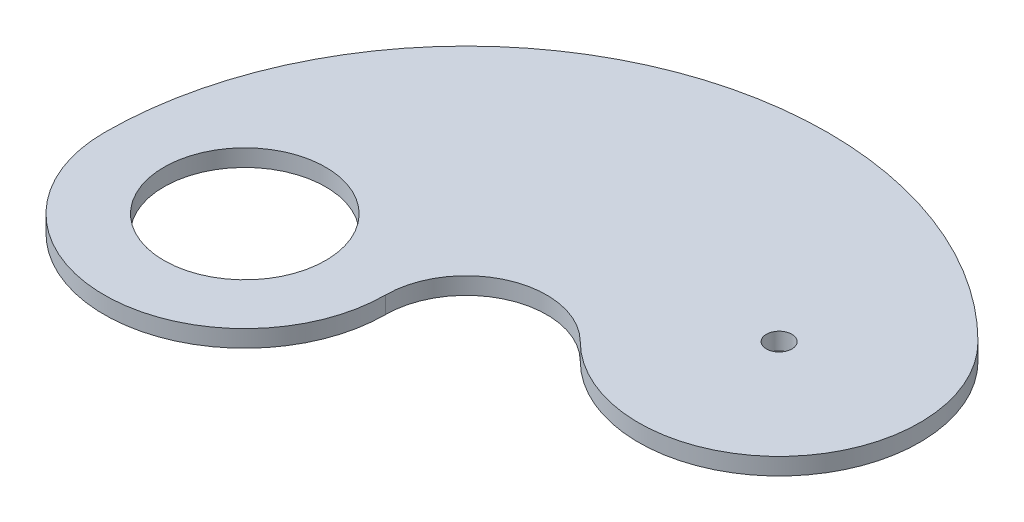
from build123d import *

# Parameters (mm, degrees)
SKETCH1_R           = 135
BOSS_EXTRUDE1_DEPTH = 6.35
SKETCH2_R           = 30.1625
CUT_EXTRUDE1_DEPTH  = 192.024402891
SKETCH3_R           = 4.7625
CUT_EXTRUDE2_DEPTH  = 192.024402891


with BuildPart() as part:
    # Sketch1 → Boss-Extrude1 (new body)
    with BuildSketch(Plane(origin=(0, 0, 0), x_dir=(1, 0, 0), z_dir=(0, 1, 0))):
        with Locations(Location((0, 0, 0), (0, 0, 270))):
            Circle(SKETCH1_R)
    extrude(amount=BOSS_EXTRUDE1_DEPTH)

    # Sketch2 → Cut-Extrude1 (cut, through all)
    with BuildSketch(Plane(origin=(0, 6.35, 0), x_dir=(1, 0, 0), z_dir=(0, 1, 0))):
        with BuildLine():
            ThreePointArc((-30.1, 0), (-82.55, -52.45), (-135, 0))
            ThreePointArc((-135, 0), (0, -135), (135, 0))
            ThreePointArc((135, 0), (124.723736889, 51.662263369), (95.45941546, 95.45941546))
            ThreePointArc((95.45941546, 95.45941546), (95.45941546, 21.283914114), (21.283914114, 21.283914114))
            ThreePointArc((21.283914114, 21.283914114), (-11.518771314, 27.808773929), (-30.1, 0))
        make_face()
        with Locations(Location((-82.55, 0, 0), (0, 0, 270))):
            Circle(SKETCH2_R)
    extrude(amount=-CUT_EXTRUDE1_DEPTH, mode=Mode.SUBTRACT)

    # Sketch3 → Cut-Extrude2 (cut, through all)
    with BuildSketch(Plane(origin=(0, 6.35, 0), x_dir=(1, 0, 0), z_dir=(0, 1, 0))):
        with Locations(Location((58.371664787, 58.371664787, 0), (0, 0, 270))):
            Circle(SKETCH3_R)
    extrude(amount=-CUT_EXTRUDE2_DEPTH, mode=Mode.SUBTRACT)


solid = part.part
